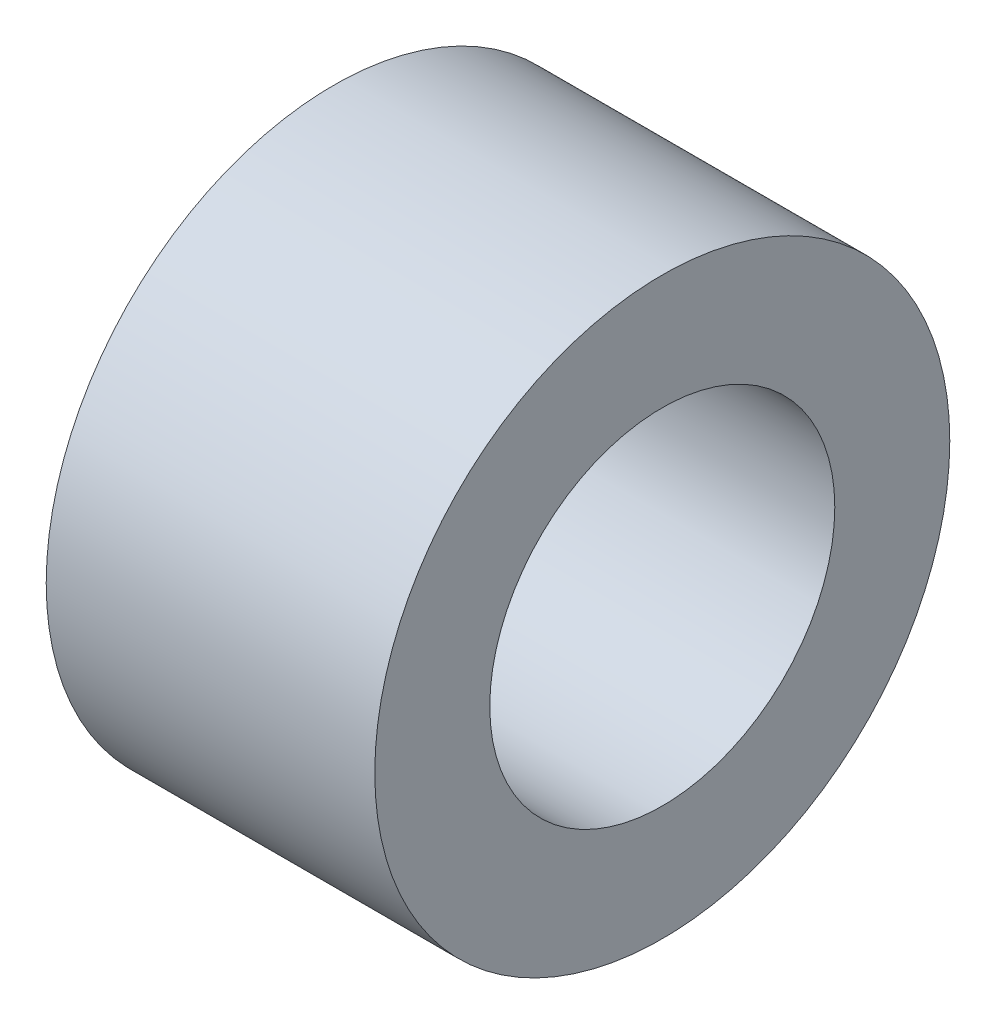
ISO-10303-21;
HEADER;
FILE_DESCRIPTION(('STEP AP214'),'2;1');
FILE_NAME('part.step','',(''),(''),'','','');
FILE_SCHEMA(('AUTOMOTIVE_DESIGN { 1 0 10303 214 1 1 1 1 }'));
ENDSEC;
DATA;
#1=APPLICATION_CONTEXT('core data for automotive mechanical design processes');
#2=APPLICATION_PROTOCOL_DEFINITION('international standard','automotive_design',2000,#1);
#3=PRODUCT_CONTEXT('',#1,'mechanical');
#4=PRODUCT('Part','Part','',(#3));
#5=PRODUCT_RELATED_PRODUCT_CATEGORY('part','',(#4));
#6=PRODUCT_DEFINITION_FORMATION('','',#4);
#7=PRODUCT_DEFINITION_CONTEXT('part definition',#1,'design');
#8=PRODUCT_DEFINITION('design','',#6,#7);
#9=PRODUCT_DEFINITION_SHAPE('','',#8);
#10=(LENGTH_UNIT() NAMED_UNIT(*) SI_UNIT(.MILLI.,.METRE.));
#11=(NAMED_UNIT(*) PLANE_ANGLE_UNIT() SI_UNIT($,.RADIAN.));
#12=(NAMED_UNIT(*) SI_UNIT($,.STERADIAN.) SOLID_ANGLE_UNIT());
#13=UNCERTAINTY_MEASURE_WITH_UNIT(LENGTH_MEASURE(1.E-05),#10,'distance_accuracy_value','');
#14=(GEOMETRIC_REPRESENTATION_CONTEXT(3) GLOBAL_UNCERTAINTY_ASSIGNED_CONTEXT((#13)) GLOBAL_UNIT_ASSIGNED_CONTEXT((#10,
#11,#12)) REPRESENTATION_CONTEXT('',''));
#15=CARTESIAN_POINT('',(0.,0.,0.));
#16=DIRECTION('',(0.,0.,1.));
#17=DIRECTION('',(1.,0.,0.));
#18=AXIS2_PLACEMENT_3D('',#15,#16,#17);
#19=CARTESIAN_POINT('',(0.,0.,-7.));
#20=DIRECTION('',(1.,0.,0.));
#21=DIRECTION('',(0.,0.,-1.));
#22=AXIS2_PLACEMENT_3D('',#19,#20,#21);
#23=PLANE('',#22);
#24=CARTESIAN_POINT('',(0.,0.,0.));
#25=DIRECTION('',(-1.,0.,0.));
#26=DIRECTION('',(0.,0.,1.));
#27=AXIS2_PLACEMENT_3D('',#24,#25,#26);
#28=CIRCLE('',#27,4.2);
#29=CARTESIAN_POINT('',(0.,0.,4.2));
#30=VERTEX_POINT('',#29);
#31=EDGE_CURVE('E10',#30,#30,#28,.T.);
#32=ORIENTED_EDGE('',*,*,#31,.F.);
#33=EDGE_LOOP('',(#32));
#34=FACE_BOUND('',#33,.T.);
#35=CARTESIAN_POINT('',(0.,0.,0.));
#36=DIRECTION('',(-1.,0.,0.));
#37=DIRECTION('',(0.,0.,1.));
#38=AXIS2_PLACEMENT_3D('',#35,#36,#37);
#39=CIRCLE('',#38,7.);
#40=CARTESIAN_POINT('',(0.,0.,7.));
#41=VERTEX_POINT('',#40);
#42=EDGE_CURVE('E45',#41,#41,#39,.T.);
#43=ORIENTED_EDGE('',*,*,#42,.T.);
#44=EDGE_LOOP('',(#43));
#45=FACE_BOUND('',#44,.T.);
#46=ADVANCED_FACE('F31',(#34,#45),#23,.F.);
#47=CARTESIAN_POINT('',(0.,0.,0.));
#48=DIRECTION('',(-1.,0.,0.));
#49=DIRECTION('',(0.,0.,1.));
#50=AXIS2_PLACEMENT_3D('',#47,#48,#49);
#51=CYLINDRICAL_SURFACE('',#50,4.2);
#52=CARTESIAN_POINT('',(8.,0.,0.));
#53=DIRECTION('',(-1.,0.,0.));
#54=DIRECTION('',(0.,0.,1.));
#55=AXIS2_PLACEMENT_3D('',#52,#53,#54);
#56=CIRCLE('',#55,4.2);
#57=CARTESIAN_POINT('',(8.,0.,4.2));
#58=VERTEX_POINT('',#57);
#59=EDGE_CURVE('E37',#58,#58,#56,.T.);
#60=ORIENTED_EDGE('',*,*,#59,.F.);
#61=EDGE_LOOP('',(#60));
#62=FACE_BOUND('',#61,.T.);
#63=ORIENTED_EDGE('',*,*,#31,.T.);
#64=EDGE_LOOP('',(#63));
#65=FACE_BOUND('',#64,.T.);
#66=ADVANCED_FACE('F60',(#62,#65),#51,.F.);
#67=CARTESIAN_POINT('',(8.,0.,-7.));
#68=DIRECTION('',(-1.,0.,0.));
#69=DIRECTION('',(0.,0.,1.));
#70=AXIS2_PLACEMENT_3D('',#67,#68,#69);
#71=PLANE('',#70);
#72=CARTESIAN_POINT('',(8.,0.,0.));
#73=DIRECTION('',(-1.,0.,0.));
#74=DIRECTION('',(0.,0.,1.));
#75=AXIS2_PLACEMENT_3D('',#72,#73,#74);
#76=CIRCLE('',#75,7.);
#77=CARTESIAN_POINT('',(8.,0.,7.));
#78=VERTEX_POINT('',#77);
#79=EDGE_CURVE('E41',#78,#78,#76,.T.);
#80=ORIENTED_EDGE('',*,*,#79,.F.);
#81=EDGE_LOOP('',(#80));
#82=FACE_BOUND('',#81,.T.);
#83=ORIENTED_EDGE('',*,*,#59,.T.);
#84=EDGE_LOOP('',(#83));
#85=FACE_BOUND('',#84,.T.);
#86=ADVANCED_FACE('F55',(#82,#85),#71,.F.);
#87=CARTESIAN_POINT('',(0.,0.,0.));
#88=DIRECTION('',(-1.,0.,0.));
#89=DIRECTION('',(0.,0.,1.));
#90=AXIS2_PLACEMENT_3D('',#87,#88,#89);
#91=CYLINDRICAL_SURFACE('',#90,7.);
#92=ORIENTED_EDGE('',*,*,#42,.F.);
#93=EDGE_LOOP('',(#92));
#94=FACE_BOUND('',#93,.T.);
#95=ORIENTED_EDGE('',*,*,#79,.T.);
#96=EDGE_LOOP('',(#95));
#97=FACE_BOUND('',#96,.T.);
#98=ADVANCED_FACE('F52',(#94,#97),#91,.T.);
#99=CLOSED_SHELL('',(#46,#66,#86,#98));
#100=MANIFOLD_SOLID_BREP('B2',#99);
#101=ADVANCED_BREP_SHAPE_REPRESENTATION('',(#18,#100),#14);
#102=SHAPE_DEFINITION_REPRESENTATION(#9,#101);
ENDSEC;
END-ISO-10303-21;
